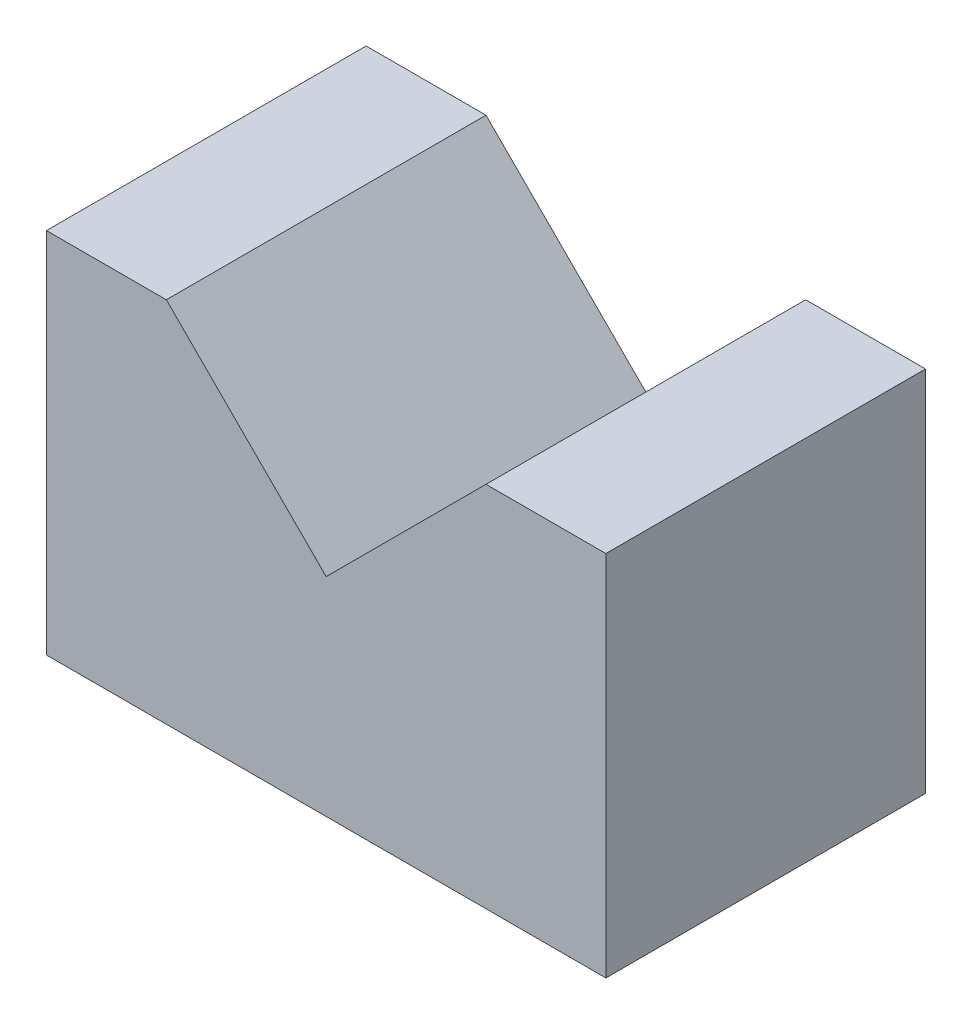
from build123d import *

# Parameters (mm, degrees)
EXTRUSION1_DEPTH = 40


with BuildPart() as part:
    # Esquisse1 → Extrusion1 (new body)
    with BuildSketch(Plane.XY):
        Polygon((0, 0), (0, 46), (15, 46), (34.999997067, 26), (55, 46), (70, 46), (70, 0), align=None)
    extrude(amount=EXTRUSION1_DEPTH)


solid = part.part
